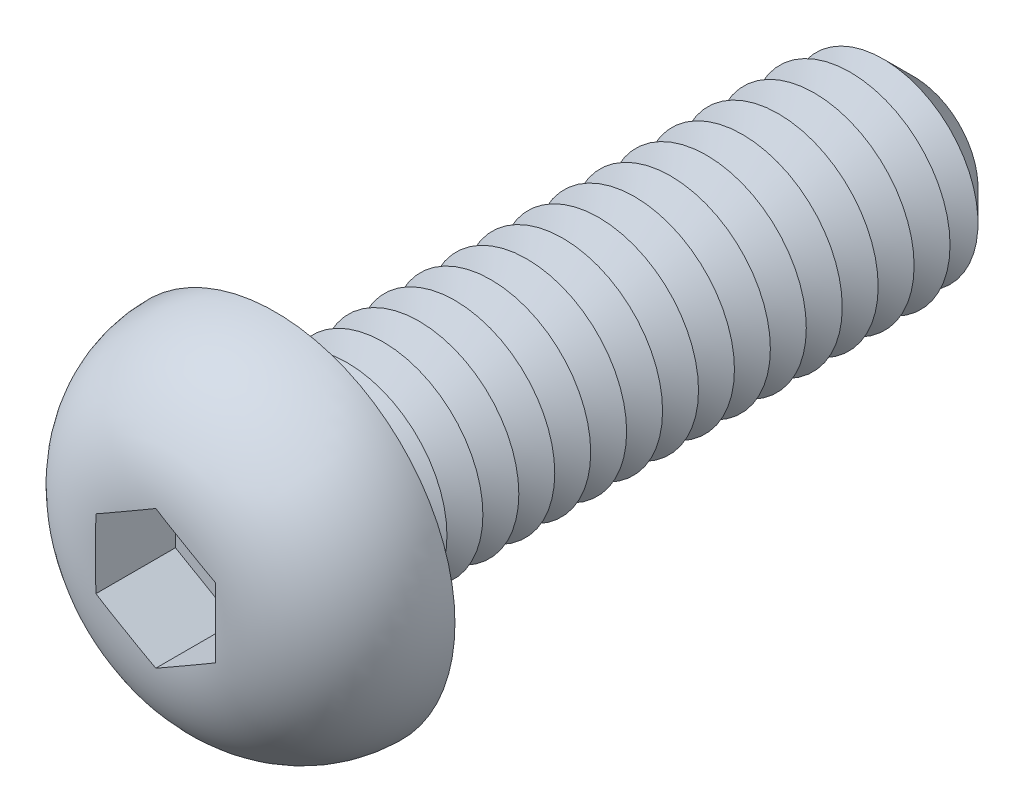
from build123d import *

# Parameters (mm, degrees)
CUT_EXTRUDE1_DEPTH  = 1
SKETCH4_R           = 1.25
BOSS_EXTRUDE1_DEPTH = 8
CHAMFER1_SIZE       = 0.45
LPATTERN1_COUNT     = 16
LPATTERN1_PITCH     = 0.45
FILLET2_R           = 0.225
SKETCH6_R           = 0.45
CUT_EXTRUDE2_DEPTH  = 8.5


with BuildPart() as part:
    # Sketch2 → Revolve1 (revolve)
    with BuildSketch(Plane(origin=(0, 0, 0), x_dir=(0, 0, -1), z_dir=(1, 0, 0)), mode=Mode.PRIVATE) as revolve1_sk:
        with BuildLine():
            Line((0, 0), (-1.5, 0))
            Line((-1.5, 0), (-1.5, 0.75))
            ThreePointArc((-1.5, 0.75), (-1.060660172, 1.810660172), (0, 2.25))
            Line((0, 2.25), (0, 0))
        make_face()
    revolve(revolve1_sk.sketch.rotate(Axis((0, 0, 47.934239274), (0, 0, -1)), 90), axis=Axis((0, 0, 47.934239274), (0, 0, -1)))

    # Sketch3 → Cut-Extrude1 (cut)
    with BuildSketch(Plane.XY.offset(1.5)):
        Polygon((0, 0.866025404), (-0.75, 0.433012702), (-0.75, -0.433012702), (0, -0.866025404), (0.75, -0.433012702), (0.75, 0.433012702), align=None)
    extrude(amount=-CUT_EXTRUDE1_DEPTH, mode=Mode.SUBTRACT)

    # Sketch4 → Boss-Extrude1 (add)
    with BuildSketch(Plane(origin=(0, 0, 0), x_dir=(-1, 0, 0), z_dir=(0, 0, -1))):
        with Locations(Location((0, 0, 0), (0, 0, 180))):
            Circle(SKETCH4_R)
    extrude(amount=BOSS_EXTRUDE1_DEPTH)

    # Chamfer1
    chamfer1_edges = [part.edges().sort_by_distance(p)[0] for p in [
        (-1.25, 0, -8),
    ]]
    chamfer(chamfer1_edges, length=CHAMFER1_SIZE)

    # Sketch5 → Cut-Revolve1 (revolve, cut)
    with BuildSketch(Plane(origin=(0, 0, 0), x_dir=(0, 0, -1), z_dir=(1, 0, 0)), mode=Mode.PRIVATE) as cut_revolve1_sk:
        Polygon((0.45, 1.25), (0.9, 1.25), (0.675, 0.860288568), align=None)
    cut_revolve1 = revolve(cut_revolve1_sk.sketch.rotate(Axis((0, 0, 47.934239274), (0, 0, -1)), 90), axis=Axis((0, 0, 47.934239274), (0, 0, -1)), mode=Mode.SUBTRACT)

    # LPattern1: Cut-Revolve1 ×16
    with Locations(*[(0, 0, -i * LPATTERN1_PITCH) for i in range(1, LPATTERN1_COUNT)]):
        add(cut_revolve1, mode=Mode.SUBTRACT)

    # Fillet2
    fillet2_edges = [part.edges().sort_by_distance(p)[0] for p in [
        (-1.25, 0, 0),
    ]]
    fillet(fillet2_edges, radius=FILLET2_R)

    # Sketch6 → Cut-Extrude2 (cut)
    with BuildSketch(Plane.XY.offset(0.5)):
        Circle(SKETCH6_R)
    extrude(amount=-CUT_EXTRUDE2_DEPTH, mode=Mode.SUBTRACT)


solid = part.part
